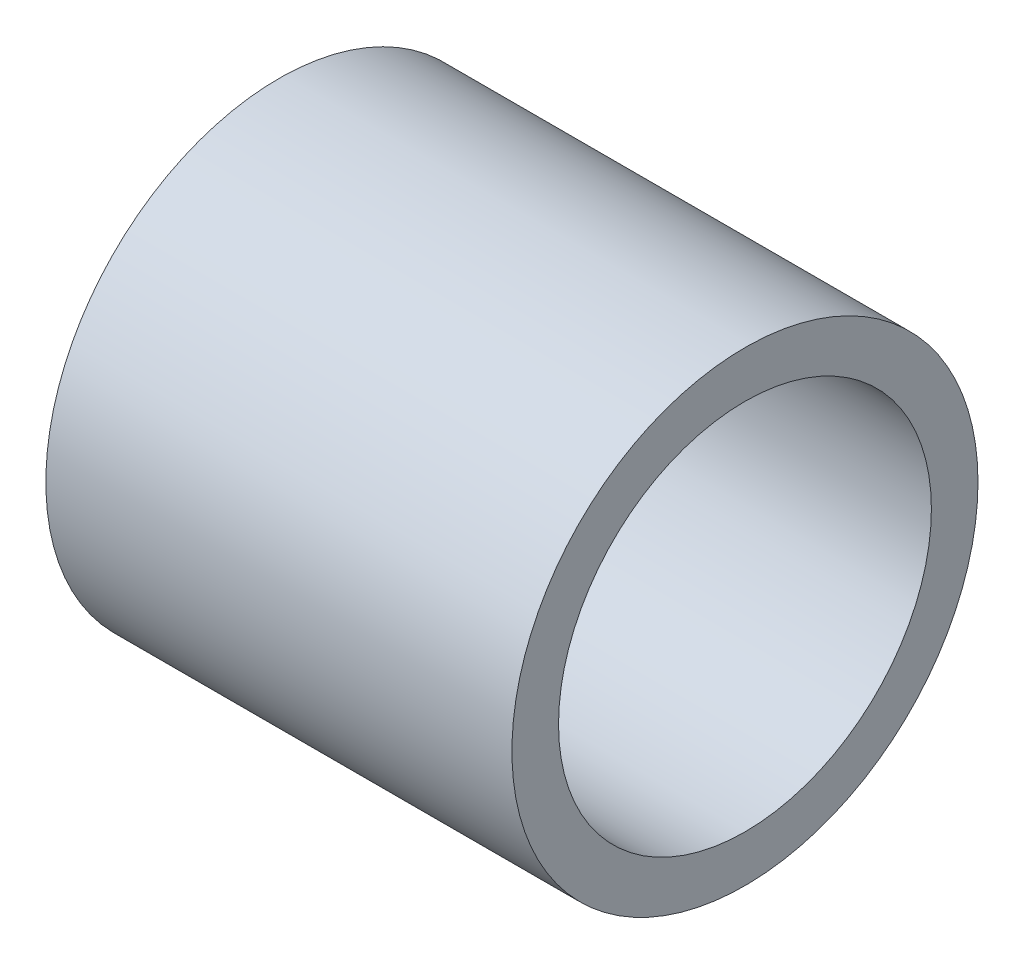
ISO-10303-21;
HEADER;
FILE_DESCRIPTION(('STEP AP214'),'2;1');
FILE_NAME('part.step','',(''),(''),'','','');
FILE_SCHEMA(('AUTOMOTIVE_DESIGN { 1 0 10303 214 1 1 1 1 }'));
ENDSEC;
DATA;
#1=APPLICATION_CONTEXT('core data for automotive mechanical design processes');
#2=APPLICATION_PROTOCOL_DEFINITION('international standard','automotive_design',2000,#1);
#3=PRODUCT_CONTEXT('',#1,'mechanical');
#4=PRODUCT('Part','Part','',(#3));
#5=PRODUCT_RELATED_PRODUCT_CATEGORY('part','',(#4));
#6=PRODUCT_DEFINITION_FORMATION('','',#4);
#7=PRODUCT_DEFINITION_CONTEXT('part definition',#1,'design');
#8=PRODUCT_DEFINITION('design','',#6,#7);
#9=PRODUCT_DEFINITION_SHAPE('','',#8);
#10=(LENGTH_UNIT() NAMED_UNIT(*) SI_UNIT(.MILLI.,.METRE.));
#11=(NAMED_UNIT(*) PLANE_ANGLE_UNIT() SI_UNIT($,.RADIAN.));
#12=(NAMED_UNIT(*) SI_UNIT($,.STERADIAN.) SOLID_ANGLE_UNIT());
#13=UNCERTAINTY_MEASURE_WITH_UNIT(LENGTH_MEASURE(1.E-05),#10,'distance_accuracy_value','');
#14=(GEOMETRIC_REPRESENTATION_CONTEXT(3) GLOBAL_UNCERTAINTY_ASSIGNED_CONTEXT((#13)) GLOBAL_UNIT_ASSIGNED_CONTEXT((#10,
#11,#12)) REPRESENTATION_CONTEXT('',''));
#15=CARTESIAN_POINT('',(0.,0.,0.));
#16=DIRECTION('',(0.,0.,1.));
#17=DIRECTION('',(1.,0.,0.));
#18=AXIS2_PLACEMENT_3D('',#15,#16,#17);
#19=CARTESIAN_POINT('',(-5.,0.,0.));
#20=DIRECTION('',(1.,0.,0.));
#21=DIRECTION('',(0.,0.,-1.));
#22=AXIS2_PLACEMENT_3D('',#19,#20,#21);
#23=CYLINDRICAL_SURFACE('',#22,4.);
#24=CARTESIAN_POINT('',(5.,0.,0.));
#25=DIRECTION('',(1.,0.,0.));
#26=DIRECTION('',(0.,0.,-1.));
#27=AXIS2_PLACEMENT_3D('',#24,#25,#26);
#28=CIRCLE('',#27,4.);
#29=CARTESIAN_POINT('',(5.,0.,-4.));
#30=VERTEX_POINT('',#29);
#31=EDGE_CURVE('E18',#30,#30,#28,.F.);
#32=ORIENTED_EDGE('',*,*,#31,.F.);
#33=EDGE_LOOP('',(#32));
#34=FACE_BOUND('',#33,.T.);
#35=CARTESIAN_POINT('',(-5.,0.,0.));
#36=DIRECTION('',(1.,0.,0.));
#37=DIRECTION('',(0.,0.,-1.));
#38=AXIS2_PLACEMENT_3D('',#35,#36,#37);
#39=CIRCLE('',#38,4.);
#40=CARTESIAN_POINT('',(-5.,0.,-4.));
#41=VERTEX_POINT('',#40);
#42=EDGE_CURVE('E27',#41,#41,#39,.F.);
#43=ORIENTED_EDGE('',*,*,#42,.T.);
#44=EDGE_LOOP('',(#43));
#45=FACE_BOUND('',#44,.T.);
#46=ADVANCED_FACE('F14',(#34,#45),#23,.F.);
#47=CARTESIAN_POINT('',(5.,0.,0.));
#48=DIRECTION('',(1.,0.,0.));
#49=DIRECTION('',(0.,0.,-1.));
#50=AXIS2_PLACEMENT_3D('',#47,#48,#49);
#51=PLANE('',#50);
#52=ORIENTED_EDGE('',*,*,#31,.T.);
#53=EDGE_LOOP('',(#52));
#54=FACE_BOUND('',#53,.T.);
#55=CARTESIAN_POINT('',(5.,0.,0.));
#56=DIRECTION('',(1.,0.,0.));
#57=DIRECTION('',(0.,0.,-1.));
#58=AXIS2_PLACEMENT_3D('',#55,#56,#57);
#59=CIRCLE('',#58,5.);
#60=CARTESIAN_POINT('',(5.,0.,-5.));
#61=VERTEX_POINT('',#60);
#62=EDGE_CURVE('E22',#61,#61,#59,.F.);
#63=ORIENTED_EDGE('',*,*,#62,.F.);
#64=EDGE_LOOP('',(#63));
#65=FACE_BOUND('',#64,.T.);
#66=ADVANCED_FACE('F35',(#54,#65),#51,.T.);
#67=CARTESIAN_POINT('',(-5.,0.,0.));
#68=DIRECTION('',(1.,0.,0.));
#69=DIRECTION('',(0.,0.,-1.));
#70=AXIS2_PLACEMENT_3D('',#67,#68,#69);
#71=PLANE('',#70);
#72=ORIENTED_EDGE('',*,*,#42,.F.);
#73=EDGE_LOOP('',(#72));
#74=FACE_BOUND('',#73,.T.);
#75=CARTESIAN_POINT('',(-5.,0.,0.));
#76=DIRECTION('',(1.,0.,0.));
#77=DIRECTION('',(0.,0.,-1.));
#78=AXIS2_PLACEMENT_3D('',#75,#76,#77);
#79=CIRCLE('',#78,5.);
#80=CARTESIAN_POINT('',(-5.,0.,-5.));
#81=VERTEX_POINT('',#80);
#82=EDGE_CURVE('E10',#81,#81,#79,.T.);
#83=ORIENTED_EDGE('',*,*,#82,.F.);
#84=EDGE_LOOP('',(#83));
#85=FACE_BOUND('',#84,.T.);
#86=ADVANCED_FACE('F44',(#74,#85),#71,.F.);
#87=CARTESIAN_POINT('',(-5.,0.,0.));
#88=DIRECTION('',(1.,0.,0.));
#89=DIRECTION('',(0.,0.,-1.));
#90=AXIS2_PLACEMENT_3D('',#87,#88,#89);
#91=CYLINDRICAL_SURFACE('',#90,5.);
#92=ORIENTED_EDGE('',*,*,#62,.T.);
#93=EDGE_LOOP('',(#92));
#94=FACE_BOUND('',#93,.T.);
#95=ORIENTED_EDGE('',*,*,#82,.T.);
#96=EDGE_LOOP('',(#95));
#97=FACE_BOUND('',#96,.T.);
#98=ADVANCED_FACE('F16',(#94,#97),#91,.T.);
#99=CLOSED_SHELL('',(#46,#66,#86,#98));
#100=MANIFOLD_SOLID_BREP('B1',#99);
#101=ADVANCED_BREP_SHAPE_REPRESENTATION('',(#18,#100),#14);
#102=SHAPE_DEFINITION_REPRESENTATION(#9,#101);
ENDSEC;
END-ISO-10303-21;
